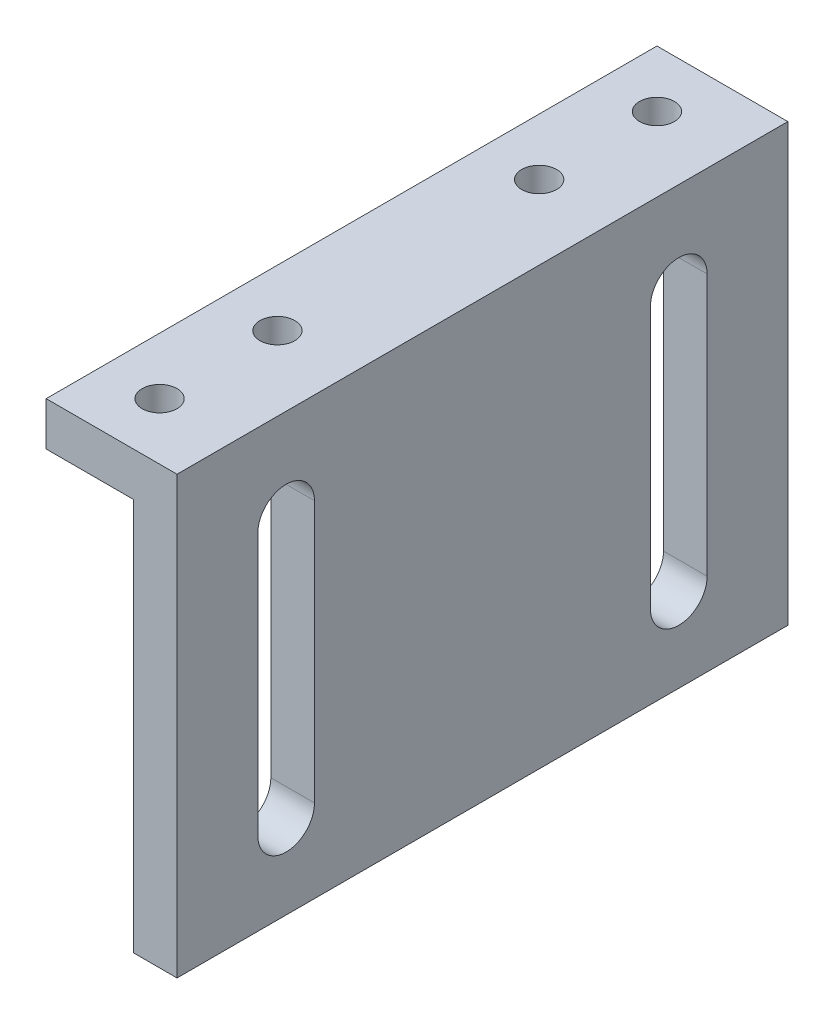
ISO-10303-21;
HEADER;
FILE_DESCRIPTION(('STEP AP214'),'2;1');
FILE_NAME('part.step','',(''),(''),'','','');
FILE_SCHEMA(('AUTOMOTIVE_DESIGN { 1 0 10303 214 1 1 1 1 }'));
ENDSEC;
DATA;
#1=APPLICATION_CONTEXT('core data for automotive mechanical design processes');
#2=APPLICATION_PROTOCOL_DEFINITION('international standard','automotive_design',2000,#1);
#3=PRODUCT_CONTEXT('',#1,'mechanical');
#4=PRODUCT('Part','Part','',(#3));
#5=PRODUCT_RELATED_PRODUCT_CATEGORY('part','',(#4));
#6=PRODUCT_DEFINITION_FORMATION('','',#4);
#7=PRODUCT_DEFINITION_CONTEXT('part definition',#1,'design');
#8=PRODUCT_DEFINITION('design','',#6,#7);
#9=PRODUCT_DEFINITION_SHAPE('','',#8);
#10=(LENGTH_UNIT() NAMED_UNIT(*) SI_UNIT(.MILLI.,.METRE.));
#11=(NAMED_UNIT(*) PLANE_ANGLE_UNIT() SI_UNIT($,.RADIAN.));
#12=(NAMED_UNIT(*) SI_UNIT($,.STERADIAN.) SOLID_ANGLE_UNIT());
#13=UNCERTAINTY_MEASURE_WITH_UNIT(LENGTH_MEASURE(1.E-05),#10,'distance_accuracy_value','');
#14=(GEOMETRIC_REPRESENTATION_CONTEXT(3) GLOBAL_UNCERTAINTY_ASSIGNED_CONTEXT((#13)) GLOBAL_UNIT_ASSIGNED_CONTEXT((#10,
#11,#12)) REPRESENTATION_CONTEXT('',''));
#15=CARTESIAN_POINT('',(0.,0.,0.));
#16=DIRECTION('',(0.,0.,1.));
#17=DIRECTION('',(1.,0.,0.));
#18=AXIS2_PLACEMENT_3D('',#15,#16,#17);
#19=CARTESIAN_POINT('',(3.5,-5.,0.));
#20=DIRECTION('',(0.,-1.,0.));
#21=DIRECTION('',(0.,0.,-1.));
#22=AXIS2_PLACEMENT_3D('',#19,#20,#21);
#23=PLANE('',#22);
#24=CARTESIAN_POINT('',(0.,-5.,28.5));
#25=DIRECTION('',(0.,1.,0.));
#26=DIRECTION('',(-1.,0.,0.));
#27=AXIS2_PLACEMENT_3D('',#24,#25,#26);
#28=CIRCLE('',#27,2.);
#29=CARTESIAN_POINT('',(-2.,-5.,28.5));
#30=VERTEX_POINT('',#29);
#31=EDGE_CURVE('E137',#30,#30,#28,.T.);
#32=ORIENTED_EDGE('',*,*,#31,.T.);
#33=EDGE_LOOP('',(#32));
#34=FACE_BOUND('',#33,.T.);
#35=CARTESIAN_POINT('',(0.,-5.,15.));
#36=DIRECTION('',(0.,1.,0.));
#37=DIRECTION('',(-1.,0.,0.));
#38=AXIS2_PLACEMENT_3D('',#35,#36,#37);
#39=CIRCLE('',#38,2.);
#40=CARTESIAN_POINT('',(-2.,-5.,15.));
#41=VERTEX_POINT('',#40);
#42=EDGE_CURVE('E197',#41,#41,#39,.T.);
#43=ORIENTED_EDGE('',*,*,#42,.T.);
#44=EDGE_LOOP('',(#43));
#45=FACE_BOUND('',#44,.T.);
#46=CARTESIAN_POINT('',(0.,-5.,-15.));
#47=DIRECTION('',(0.,1.,0.));
#48=DIRECTION('',(-1.,0.,0.));
#49=AXIS2_PLACEMENT_3D('',#46,#47,#48);
#50=CIRCLE('',#49,2.);
#51=CARTESIAN_POINT('',(-2.,-5.,-15.));
#52=VERTEX_POINT('',#51);
#53=EDGE_CURVE('E199',#52,#52,#50,.T.);
#54=ORIENTED_EDGE('',*,*,#53,.T.);
#55=EDGE_LOOP('',(#54));
#56=FACE_BOUND('',#55,.T.);
#57=CARTESIAN_POINT('',(0.,-5.,-28.5));
#58=DIRECTION('',(0.,1.,0.));
#59=DIRECTION('',(-1.,0.,0.));
#60=AXIS2_PLACEMENT_3D('',#57,#58,#59);
#61=CIRCLE('',#60,2.);
#62=CARTESIAN_POINT('',(-2.,-5.,-28.5));
#63=VERTEX_POINT('',#62);
#64=EDGE_CURVE('E18',#63,#63,#61,.T.);
#65=ORIENTED_EDGE('',*,*,#64,.T.);
#66=EDGE_LOOP('',(#65));
#67=FACE_BOUND('',#66,.T.);
#68=DIRECTION('',(1.,0.,0.));
#69=VECTOR('',#68,1.);
#70=CARTESIAN_POINT('',(4.46153846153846,-5.,-35.));
#71=LINE('',#70,#69);
#72=CARTESIAN_POINT('',(-6.5,-5.,-35.));
#73=VERTEX_POINT('',#72);
#74=CARTESIAN_POINT('',(3.5,-5.,-35.));
#75=VERTEX_POINT('',#74);
#76=EDGE_CURVE('E238',#73,#75,#71,.T.);
#77=ORIENTED_EDGE('',*,*,#76,.T.);
#78=DIRECTION('',(0.,0.,1.));
#79=VECTOR('',#78,1.);
#80=CARTESIAN_POINT('',(3.5,-5.,0.));
#81=LINE('',#80,#79);
#82=CARTESIAN_POINT('',(3.5,-5.,35.));
#83=VERTEX_POINT('',#82);
#84=EDGE_CURVE('E116',#83,#75,#81,.F.);
#85=ORIENTED_EDGE('',*,*,#84,.F.);
#86=DIRECTION('',(1.,0.,0.));
#87=VECTOR('',#86,1.);
#88=CARTESIAN_POINT('',(4.46153846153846,-5.,35.));
#89=LINE('',#88,#87);
#90=CARTESIAN_POINT('',(-6.5,-5.,35.));
#91=VERTEX_POINT('',#90);
#92=EDGE_CURVE('E127',#91,#83,#89,.T.);
#93=ORIENTED_EDGE('',*,*,#92,.F.);
#94=DIRECTION('',(0.,0.,1.));
#95=VECTOR('',#94,1.);
#96=CARTESIAN_POINT('',(-6.5,-5.,0.));
#97=LINE('',#96,#95);
#98=EDGE_CURVE('E120',#73,#91,#97,.T.);
#99=ORIENTED_EDGE('',*,*,#98,.F.);
#100=EDGE_LOOP('',(#77,#85,#93,#99));
#101=FACE_BOUND('',#100,.T.);
#102=ADVANCED_FACE('F15',(#34,#45,#56,#67,#101),#23,.T.);
#103=CARTESIAN_POINT('',(-6.5,-5.,0.));
#104=DIRECTION('',(-1.,0.,0.));
#105=DIRECTION('',(0.,0.,1.));
#106=AXIS2_PLACEMENT_3D('',#103,#104,#105);
#107=PLANE('',#106);
#108=DIRECTION('',(0.,1.,0.));
#109=VECTOR('',#108,1.);
#110=CARTESIAN_POINT('',(-6.5,-21.5384615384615,-35.));
#111=LINE('',#110,#109);
#112=CARTESIAN_POINT('',(-6.5,0.,-35.));
#113=VERTEX_POINT('',#112);
#114=EDGE_CURVE('E92',#113,#73,#111,.F.);
#115=ORIENTED_EDGE('',*,*,#114,.T.);
#116=ORIENTED_EDGE('',*,*,#98,.T.);
#117=DIRECTION('',(0.,1.,0.));
#118=VECTOR('',#117,1.);
#119=CARTESIAN_POINT('',(-6.5,-21.5384615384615,35.));
#120=LINE('',#119,#118);
#121=CARTESIAN_POINT('',(-6.5,0.,35.));
#122=VERTEX_POINT('',#121);
#123=EDGE_CURVE('E123',#122,#91,#120,.F.);
#124=ORIENTED_EDGE('',*,*,#123,.F.);
#125=DIRECTION('',(0.,0.,1.));
#126=VECTOR('',#125,1.);
#127=CARTESIAN_POINT('',(-6.5,0.,0.));
#128=LINE('',#127,#126);
#129=EDGE_CURVE('E194',#113,#122,#128,.T.);
#130=ORIENTED_EDGE('',*,*,#129,.F.);
#131=EDGE_LOOP('',(#115,#116,#124,#130));
#132=FACE_BOUND('',#131,.T.);
#133=ADVANCED_FACE('F121',(#132),#107,.T.);
#134=CARTESIAN_POINT('',(0.,-5.,-28.5));
#135=DIRECTION('',(0.,1.,0.));
#136=DIRECTION('',(-1.,0.,0.));
#137=AXIS2_PLACEMENT_3D('',#134,#135,#136);
#138=CYLINDRICAL_SURFACE('',#137,2.);
#139=ORIENTED_EDGE('',*,*,#64,.F.);
#140=EDGE_LOOP('',(#139));
#141=FACE_BOUND('',#140,.T.);
#142=CARTESIAN_POINT('',(0.,0.,-28.5));
#143=DIRECTION('',(0.,1.,0.));
#144=DIRECTION('',(-1.,0.,0.));
#145=AXIS2_PLACEMENT_3D('',#142,#143,#144);
#146=CIRCLE('',#145,2.);
#147=CARTESIAN_POINT('',(-2.,0.,-28.5));
#148=VERTEX_POINT('',#147);
#149=EDGE_CURVE('E191',#148,#148,#146,.F.);
#150=ORIENTED_EDGE('',*,*,#149,.F.);
#151=EDGE_LOOP('',(#150));
#152=FACE_BOUND('',#151,.T.);
#153=ADVANCED_FACE('F207',(#141,#152),#138,.F.);
#154=CARTESIAN_POINT('',(0.,-5.,-15.));
#155=DIRECTION('',(0.,1.,0.));
#156=DIRECTION('',(-1.,0.,0.));
#157=AXIS2_PLACEMENT_3D('',#154,#155,#156);
#158=CYLINDRICAL_SURFACE('',#157,2.);
#159=ORIENTED_EDGE('',*,*,#53,.F.);
#160=EDGE_LOOP('',(#159));
#161=FACE_BOUND('',#160,.T.);
#162=CARTESIAN_POINT('',(0.,0.,-15.));
#163=DIRECTION('',(0.,1.,0.));
#164=DIRECTION('',(-1.,0.,0.));
#165=AXIS2_PLACEMENT_3D('',#162,#163,#164);
#166=CIRCLE('',#165,2.);
#167=CARTESIAN_POINT('',(-2.,0.,-15.));
#168=VERTEX_POINT('',#167);
#169=EDGE_CURVE('E188',#168,#168,#166,.F.);
#170=ORIENTED_EDGE('',*,*,#169,.F.);
#171=EDGE_LOOP('',(#170));
#172=FACE_BOUND('',#171,.T.);
#173=ADVANCED_FACE('F210',(#161,#172),#158,.F.);
#174=CARTESIAN_POINT('',(0.,-5.,15.));
#175=DIRECTION('',(0.,1.,0.));
#176=DIRECTION('',(-1.,0.,0.));
#177=AXIS2_PLACEMENT_3D('',#174,#175,#176);
#178=CYLINDRICAL_SURFACE('',#177,2.);
#179=ORIENTED_EDGE('',*,*,#42,.F.);
#180=EDGE_LOOP('',(#179));
#181=FACE_BOUND('',#180,.T.);
#182=CARTESIAN_POINT('',(0.,0.,15.));
#183=DIRECTION('',(0.,1.,0.));
#184=DIRECTION('',(-1.,0.,0.));
#185=AXIS2_PLACEMENT_3D('',#182,#183,#184);
#186=CIRCLE('',#185,2.);
#187=CARTESIAN_POINT('',(-2.,0.,15.));
#188=VERTEX_POINT('',#187);
#189=EDGE_CURVE('E185',#188,#188,#186,.F.);
#190=ORIENTED_EDGE('',*,*,#189,.F.);
#191=EDGE_LOOP('',(#190));
#192=FACE_BOUND('',#191,.T.);
#193=ADVANCED_FACE('F414',(#181,#192),#178,.F.);
#194=CARTESIAN_POINT('',(0.,-5.,28.5));
#195=DIRECTION('',(0.,1.,0.));
#196=DIRECTION('',(-1.,0.,0.));
#197=AXIS2_PLACEMENT_3D('',#194,#195,#196);
#198=CYLINDRICAL_SURFACE('',#197,2.);
#199=ORIENTED_EDGE('',*,*,#31,.F.);
#200=EDGE_LOOP('',(#199));
#201=FACE_BOUND('',#200,.T.);
#202=CARTESIAN_POINT('',(0.,0.,28.5));
#203=DIRECTION('',(0.,1.,0.));
#204=DIRECTION('',(-1.,0.,0.));
#205=AXIS2_PLACEMENT_3D('',#202,#203,#204);
#206=CIRCLE('',#205,2.);
#207=CARTESIAN_POINT('',(-2.,0.,28.5));
#208=VERTEX_POINT('',#207);
#209=EDGE_CURVE('E182',#208,#208,#206,.F.);
#210=ORIENTED_EDGE('',*,*,#209,.F.);
#211=EDGE_LOOP('',(#210));
#212=FACE_BOUND('',#211,.T.);
#213=ADVANCED_FACE('F422',(#201,#212),#198,.F.);
#214=CARTESIAN_POINT('',(3.5,-50.,0.));
#215=DIRECTION('',(-1.,0.,0.));
#216=DIRECTION('',(0.,0.,1.));
#217=AXIS2_PLACEMENT_3D('',#214,#215,#216);
#218=PLANE('',#217);
#219=DIRECTION('',(0.,1.,0.));
#220=VECTOR('',#219,1.);
#221=CARTESIAN_POINT('',(3.5,-10.5,25.75));
#222=LINE('',#221,#220);
#223=CARTESIAN_POINT('',(3.5,-10.5,25.75));
#224=VERTEX_POINT('',#223);
#225=CARTESIAN_POINT('',(3.5,-40.5,25.75));
#226=VERTEX_POINT('',#225);
#227=EDGE_CURVE('E145',#224,#226,#222,.F.);
#228=ORIENTED_EDGE('',*,*,#227,.T.);
#229=CARTESIAN_POINT('',(3.5,-40.5,22.5));
#230=DIRECTION('',(-1.,0.,0.));
#231=DIRECTION('',(0.,0.,1.));
#232=AXIS2_PLACEMENT_3D('',#229,#230,#231);
#233=CIRCLE('',#232,3.25);
#234=CARTESIAN_POINT('',(3.5,-40.5,19.25));
#235=VERTEX_POINT('',#234);
#236=EDGE_CURVE('E174',#226,#235,#233,.F.);
#237=ORIENTED_EDGE('',*,*,#236,.T.);
#238=DIRECTION('',(0.,1.,0.));
#239=VECTOR('',#238,1.);
#240=CARTESIAN_POINT('',(3.5,-40.5,19.25));
#241=LINE('',#240,#239);
#242=CARTESIAN_POINT('',(3.5,-10.5,19.25));
#243=VERTEX_POINT('',#242);
#244=EDGE_CURVE('E141',#235,#243,#241,.T.);
#245=ORIENTED_EDGE('',*,*,#244,.T.);
#246=CARTESIAN_POINT('',(3.5,-10.5,22.5));
#247=DIRECTION('',(-1.,0.,0.));
#248=DIRECTION('',(0.,0.,1.));
#249=AXIS2_PLACEMENT_3D('',#246,#247,#248);
#250=CIRCLE('',#249,3.25);
#251=EDGE_CURVE('E169',#243,#224,#250,.F.);
#252=ORIENTED_EDGE('',*,*,#251,.T.);
#253=EDGE_LOOP('',(#228,#237,#245,#252));
#254=FACE_BOUND('',#253,.T.);
#255=CARTESIAN_POINT('',(3.5,-40.5,-22.5));
#256=DIRECTION('',(-1.,0.,0.));
#257=DIRECTION('',(0.,0.,1.));
#258=AXIS2_PLACEMENT_3D('',#255,#256,#257);
#259=CIRCLE('',#258,3.25);
#260=CARTESIAN_POINT('',(3.5,-40.5,-19.25));
#261=VERTEX_POINT('',#260);
#262=CARTESIAN_POINT('',(3.5,-40.5,-25.75));
#263=VERTEX_POINT('',#262);
#264=EDGE_CURVE('E177',#261,#263,#259,.F.);
#265=ORIENTED_EDGE('',*,*,#264,.T.);
#266=DIRECTION('',(0.,1.,0.));
#267=VECTOR('',#266,1.);
#268=CARTESIAN_POINT('',(3.5,-40.5,-25.75));
#269=LINE('',#268,#267);
#270=CARTESIAN_POINT('',(3.5,-10.5,-25.75));
#271=VERTEX_POINT('',#270);
#272=EDGE_CURVE('E152',#263,#271,#269,.T.);
#273=ORIENTED_EDGE('',*,*,#272,.T.);
#274=CARTESIAN_POINT('',(3.5,-10.5,-22.5));
#275=DIRECTION('',(-1.,0.,0.));
#276=DIRECTION('',(0.,0.,1.));
#277=AXIS2_PLACEMENT_3D('',#274,#275,#276);
#278=CIRCLE('',#277,3.25);
#279=CARTESIAN_POINT('',(3.5,-10.5,-19.25));
#280=VERTEX_POINT('',#279);
#281=EDGE_CURVE('E83',#271,#280,#278,.F.);
#282=ORIENTED_EDGE('',*,*,#281,.T.);
#283=DIRECTION('',(0.,1.,0.));
#284=VECTOR('',#283,1.);
#285=CARTESIAN_POINT('',(3.5,-10.5,-19.25));
#286=LINE('',#285,#284);
#287=EDGE_CURVE('E144',#280,#261,#286,.F.);
#288=ORIENTED_EDGE('',*,*,#287,.T.);
#289=EDGE_LOOP('',(#265,#273,#282,#288));
#290=FACE_BOUND('',#289,.T.);
#291=DIRECTION('',(0.,1.,0.));
#292=VECTOR('',#291,1.);
#293=CARTESIAN_POINT('',(3.5,-21.5384615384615,-35.));
#294=LINE('',#293,#292);
#295=CARTESIAN_POINT('',(3.5,-50.,-35.));
#296=VERTEX_POINT('',#295);
#297=EDGE_CURVE('E236',#75,#296,#294,.F.);
#298=ORIENTED_EDGE('',*,*,#297,.T.);
#299=DIRECTION('',(0.,0.,-1.));
#300=VECTOR('',#299,1.);
#301=CARTESIAN_POINT('',(3.5,-50.,0.));
#302=LINE('',#301,#300);
#303=CARTESIAN_POINT('',(3.5,-50.,35.));
#304=VERTEX_POINT('',#303);
#305=EDGE_CURVE('E240',#304,#296,#302,.T.);
#306=ORIENTED_EDGE('',*,*,#305,.F.);
#307=DIRECTION('',(0.,1.,0.));
#308=VECTOR('',#307,1.);
#309=CARTESIAN_POINT('',(3.5,-21.5384615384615,35.));
#310=LINE('',#309,#308);
#311=EDGE_CURVE('E129',#83,#304,#310,.F.);
#312=ORIENTED_EDGE('',*,*,#311,.F.);
#313=ORIENTED_EDGE('',*,*,#84,.T.);
#314=EDGE_LOOP('',(#298,#306,#312,#313));
#315=FACE_BOUND('',#314,.T.);
#316=ADVANCED_FACE('F249',(#254,#290,#315),#218,.T.);
#317=CARTESIAN_POINT('',(4.46153846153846,-21.5384615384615,35.));
#318=DIRECTION('',(0.,0.,1.));
#319=DIRECTION('',(1.,0.,0.));
#320=AXIS2_PLACEMENT_3D('',#317,#318,#319);
#321=PLANE('',#320);
#322=ORIENTED_EDGE('',*,*,#311,.T.);
#323=DIRECTION('',(1.,0.,0.));
#324=VECTOR('',#323,1.);
#325=CARTESIAN_POINT('',(8.5,-50.,35.));
#326=LINE('',#325,#324);
#327=CARTESIAN_POINT('',(8.5,-50.,35.));
#328=VERTEX_POINT('',#327);
#329=EDGE_CURVE('E243',#328,#304,#326,.F.);
#330=ORIENTED_EDGE('',*,*,#329,.F.);
#331=DIRECTION('',(0.,1.,0.));
#332=VECTOR('',#331,1.);
#333=CARTESIAN_POINT('',(8.5,0.,35.));
#334=LINE('',#333,#332);
#335=CARTESIAN_POINT('',(8.5,0.,35.));
#336=VERTEX_POINT('',#335);
#337=EDGE_CURVE('E172',#336,#328,#334,.F.);
#338=ORIENTED_EDGE('',*,*,#337,.F.);
#339=DIRECTION('',(1.,0.,0.));
#340=VECTOR('',#339,1.);
#341=CARTESIAN_POINT('',(-6.5,0.,35.));
#342=LINE('',#341,#340);
#343=EDGE_CURVE('E134',#122,#336,#342,.T.);
#344=ORIENTED_EDGE('',*,*,#343,.F.);
#345=ORIENTED_EDGE('',*,*,#123,.T.);
#346=ORIENTED_EDGE('',*,*,#92,.T.);
#347=EDGE_LOOP('',(#322,#330,#338,#344,#345,#346));
#348=FACE_BOUND('',#347,.T.);
#349=ADVANCED_FACE('F131',(#348),#321,.T.);
#350=CARTESIAN_POINT('',(8.5,-50.,0.));
#351=DIRECTION('',(0.,-1.,0.));
#352=DIRECTION('',(0.,0.,-1.));
#353=AXIS2_PLACEMENT_3D('',#350,#351,#352);
#354=PLANE('',#353);
#355=DIRECTION('',(1.,0.,0.));
#356=VECTOR('',#355,1.);
#357=CARTESIAN_POINT('',(4.46153846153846,-50.,-35.));
#358=LINE('',#357,#356);
#359=CARTESIAN_POINT('',(8.5,-50.,-35.));
#360=VERTEX_POINT('',#359);
#361=EDGE_CURVE('E233',#296,#360,#358,.T.);
#362=ORIENTED_EDGE('',*,*,#361,.T.);
#363=DIRECTION('',(0.,0.,-1.));
#364=VECTOR('',#363,1.);
#365=CARTESIAN_POINT('',(8.5,-50.,0.));
#366=LINE('',#365,#364);
#367=EDGE_CURVE('E255',#328,#360,#366,.T.);
#368=ORIENTED_EDGE('',*,*,#367,.F.);
#369=ORIENTED_EDGE('',*,*,#329,.T.);
#370=ORIENTED_EDGE('',*,*,#305,.T.);
#371=EDGE_LOOP('',(#362,#368,#369,#370));
#372=FACE_BOUND('',#371,.T.);
#373=ADVANCED_FACE('F253',(#372),#354,.T.);
#374=CARTESIAN_POINT('',(4.46153846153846,-21.5384615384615,-35.));
#375=DIRECTION('',(0.,0.,1.));
#376=DIRECTION('',(1.,0.,0.));
#377=AXIS2_PLACEMENT_3D('',#374,#375,#376);
#378=PLANE('',#377);
#379=DIRECTION('',(1.,0.,0.));
#380=VECTOR('',#379,1.);
#381=CARTESIAN_POINT('',(-6.5,0.,-35.));
#382=LINE('',#381,#380);
#383=CARTESIAN_POINT('',(8.5,0.,-35.));
#384=VERTEX_POINT('',#383);
#385=EDGE_CURVE('E223',#384,#113,#382,.F.);
#386=ORIENTED_EDGE('',*,*,#385,.F.);
#387=DIRECTION('',(0.,1.,0.));
#388=VECTOR('',#387,1.);
#389=CARTESIAN_POINT('',(8.5,0.,-35.));
#390=LINE('',#389,#388);
#391=EDGE_CURVE('E259',#360,#384,#390,.T.);
#392=ORIENTED_EDGE('',*,*,#391,.F.);
#393=ORIENTED_EDGE('',*,*,#361,.F.);
#394=ORIENTED_EDGE('',*,*,#297,.F.);
#395=ORIENTED_EDGE('',*,*,#76,.F.);
#396=ORIENTED_EDGE('',*,*,#114,.F.);
#397=EDGE_LOOP('',(#386,#392,#393,#394,#395,#396));
#398=FACE_BOUND('',#397,.T.);
#399=ADVANCED_FACE('F218',(#398),#378,.F.);
#400=CARTESIAN_POINT('',(-6.5,0.,0.));
#401=DIRECTION('',(0.,1.,0.));
#402=DIRECTION('',(0.,0.,1.));
#403=AXIS2_PLACEMENT_3D('',#400,#401,#402);
#404=PLANE('',#403);
#405=ORIENTED_EDGE('',*,*,#209,.T.);
#406=EDGE_LOOP('',(#405));
#407=FACE_BOUND('',#406,.T.);
#408=ORIENTED_EDGE('',*,*,#189,.T.);
#409=EDGE_LOOP('',(#408));
#410=FACE_BOUND('',#409,.T.);
#411=ORIENTED_EDGE('',*,*,#169,.T.);
#412=EDGE_LOOP('',(#411));
#413=FACE_BOUND('',#412,.T.);
#414=ORIENTED_EDGE('',*,*,#149,.T.);
#415=EDGE_LOOP('',(#414));
#416=FACE_BOUND('',#415,.T.);
#417=ORIENTED_EDGE('',*,*,#385,.T.);
#418=ORIENTED_EDGE('',*,*,#129,.T.);
#419=ORIENTED_EDGE('',*,*,#343,.T.);
#420=DIRECTION('',(0.,0.,-1.));
#421=VECTOR('',#420,1.);
#422=CARTESIAN_POINT('',(8.5,0.,0.));
#423=LINE('',#422,#421);
#424=EDGE_CURVE('E168',#384,#336,#423,.F.);
#425=ORIENTED_EDGE('',*,*,#424,.F.);
#426=EDGE_LOOP('',(#417,#418,#419,#425));
#427=FACE_BOUND('',#426,.T.);
#428=ADVANCED_FACE('F214',(#407,#410,#413,#416,#427),#404,.T.);
#429=CARTESIAN_POINT('',(8.5,-10.5,-22.5));
#430=DIRECTION('',(-1.,0.,0.));
#431=DIRECTION('',(0.,0.,1.));
#432=AXIS2_PLACEMENT_3D('',#429,#430,#431);
#433=CYLINDRICAL_SURFACE('',#432,3.25);
#434=DIRECTION('',(-1.,0.,0.));
#435=VECTOR('',#434,1.);
#436=CARTESIAN_POINT('',(8.5,-10.5,-25.75));
#437=LINE('',#436,#435);
#438=CARTESIAN_POINT('',(8.5,-10.5,-25.75));
#439=VERTEX_POINT('',#438);
#440=EDGE_CURVE('E154',#271,#439,#437,.F.);
#441=ORIENTED_EDGE('',*,*,#440,.T.);
#442=CARTESIAN_POINT('',(8.5,-10.5,-22.5));
#443=DIRECTION('',(-1.,0.,0.));
#444=DIRECTION('',(0.,0.,1.));
#445=AXIS2_PLACEMENT_3D('',#442,#443,#444);
#446=CIRCLE('',#445,3.25);
#447=CARTESIAN_POINT('',(8.5,-10.5,-19.25));
#448=VERTEX_POINT('',#447);
#449=EDGE_CURVE('E165',#448,#439,#446,.T.);
#450=ORIENTED_EDGE('',*,*,#449,.F.);
#451=DIRECTION('',(1.,0.,0.));
#452=VECTOR('',#451,1.);
#453=CARTESIAN_POINT('',(8.5,-10.5,-19.25));
#454=LINE('',#453,#452);
#455=EDGE_CURVE('E151',#448,#280,#454,.F.);
#456=ORIENTED_EDGE('',*,*,#455,.T.);
#457=ORIENTED_EDGE('',*,*,#281,.F.);
#458=EDGE_LOOP('',(#441,#450,#456,#457));
#459=FACE_BOUND('',#458,.T.);
#460=ADVANCED_FACE('F217',(#459),#433,.F.);
#461=CARTESIAN_POINT('',(8.5,-40.5,-25.75));
#462=DIRECTION('',(0.,0.,-1.));
#463=DIRECTION('',(-1.,0.,0.));
#464=AXIS2_PLACEMENT_3D('',#461,#462,#463);
#465=PLANE('',#464);
#466=DIRECTION('',(-1.,0.,0.));
#467=VECTOR('',#466,1.);
#468=CARTESIAN_POINT('',(8.5,-40.5,-25.75));
#469=LINE('',#468,#467);
#470=CARTESIAN_POINT('',(8.5,-40.5,-25.75));
#471=VERTEX_POINT('',#470);
#472=EDGE_CURVE('E153',#263,#471,#469,.F.);
#473=ORIENTED_EDGE('',*,*,#472,.T.);
#474=DIRECTION('',(0.,1.,0.));
#475=VECTOR('',#474,1.);
#476=CARTESIAN_POINT('',(8.5,0.,-25.75));
#477=LINE('',#476,#475);
#478=EDGE_CURVE('E164',#439,#471,#477,.F.);
#479=ORIENTED_EDGE('',*,*,#478,.F.);
#480=ORIENTED_EDGE('',*,*,#440,.F.);
#481=ORIENTED_EDGE('',*,*,#272,.F.);
#482=EDGE_LOOP('',(#473,#479,#480,#481));
#483=FACE_BOUND('',#482,.T.);
#484=ADVANCED_FACE('F277',(#483),#465,.F.);
#485=CARTESIAN_POINT('',(8.5,-40.5,-22.5));
#486=DIRECTION('',(-1.,0.,0.));
#487=DIRECTION('',(0.,0.,1.));
#488=AXIS2_PLACEMENT_3D('',#485,#486,#487);
#489=CYLINDRICAL_SURFACE('',#488,3.25);
#490=DIRECTION('',(1.,0.,0.));
#491=VECTOR('',#490,1.);
#492=CARTESIAN_POINT('',(8.5,-40.5,-19.25));
#493=LINE('',#492,#491);
#494=CARTESIAN_POINT('',(8.5,-40.5,-19.25));
#495=VERTEX_POINT('',#494);
#496=EDGE_CURVE('E180',#261,#495,#493,.T.);
#497=ORIENTED_EDGE('',*,*,#496,.T.);
#498=CARTESIAN_POINT('',(8.5,-40.5,-22.5));
#499=DIRECTION('',(-1.,0.,0.));
#500=DIRECTION('',(0.,0.,1.));
#501=AXIS2_PLACEMENT_3D('',#498,#499,#500);
#502=CIRCLE('',#501,3.25);
#503=EDGE_CURVE('E160',#471,#495,#502,.T.);
#504=ORIENTED_EDGE('',*,*,#503,.F.);
#505=ORIENTED_EDGE('',*,*,#472,.F.);
#506=ORIENTED_EDGE('',*,*,#264,.F.);
#507=EDGE_LOOP('',(#497,#504,#505,#506));
#508=FACE_BOUND('',#507,.T.);
#509=ADVANCED_FACE('F327',(#508),#489,.F.);
#510=CARTESIAN_POINT('',(8.5,-10.5,-19.25));
#511=DIRECTION('',(0.,0.,1.));
#512=DIRECTION('',(1.,0.,0.));
#513=AXIS2_PLACEMENT_3D('',#510,#511,#512);
#514=PLANE('',#513);
#515=ORIENTED_EDGE('',*,*,#455,.F.);
#516=DIRECTION('',(0.,1.,0.));
#517=VECTOR('',#516,1.);
#518=CARTESIAN_POINT('',(8.5,0.,-19.25));
#519=LINE('',#518,#517);
#520=EDGE_CURVE('E163',#495,#448,#519,.T.);
#521=ORIENTED_EDGE('',*,*,#520,.F.);
#522=ORIENTED_EDGE('',*,*,#496,.F.);
#523=ORIENTED_EDGE('',*,*,#287,.F.);
#524=EDGE_LOOP('',(#515,#521,#522,#523));
#525=FACE_BOUND('',#524,.T.);
#526=ADVANCED_FACE('F323',(#525),#514,.F.);
#527=CARTESIAN_POINT('',(8.5,-40.5,19.25));
#528=DIRECTION('',(0.,0.,-1.));
#529=DIRECTION('',(-1.,0.,0.));
#530=AXIS2_PLACEMENT_3D('',#527,#528,#529);
#531=PLANE('',#530);
#532=DIRECTION('',(-1.,0.,0.));
#533=VECTOR('',#532,1.);
#534=CARTESIAN_POINT('',(8.5,-40.5,19.25));
#535=LINE('',#534,#533);
#536=CARTESIAN_POINT('',(8.5,-40.5,19.25));
#537=VERTEX_POINT('',#536);
#538=EDGE_CURVE('E143',#235,#537,#535,.F.);
#539=ORIENTED_EDGE('',*,*,#538,.T.);
#540=DIRECTION('',(0.,1.,0.));
#541=VECTOR('',#540,1.);
#542=CARTESIAN_POINT('',(8.5,0.,19.25));
#543=LINE('',#542,#541);
#544=CARTESIAN_POINT('',(8.5,-10.5,19.25));
#545=VERTEX_POINT('',#544);
#546=EDGE_CURVE('E159',#545,#537,#543,.F.);
#547=ORIENTED_EDGE('',*,*,#546,.F.);
#548=DIRECTION('',(-1.,0.,0.));
#549=VECTOR('',#548,1.);
#550=CARTESIAN_POINT('',(8.5,-10.5,19.25));
#551=LINE('',#550,#549);
#552=EDGE_CURVE('E173',#545,#243,#551,.T.);
#553=ORIENTED_EDGE('',*,*,#552,.T.);
#554=ORIENTED_EDGE('',*,*,#244,.F.);
#555=EDGE_LOOP('',(#539,#547,#553,#554));
#556=FACE_BOUND('',#555,.T.);
#557=ADVANCED_FACE('F319',(#556),#531,.F.);
#558=CARTESIAN_POINT('',(8.5,-40.5,22.5));
#559=DIRECTION('',(-1.,0.,0.));
#560=DIRECTION('',(0.,0.,1.));
#561=AXIS2_PLACEMENT_3D('',#558,#559,#560);
#562=CYLINDRICAL_SURFACE('',#561,3.25);
#563=DIRECTION('',(1.,0.,0.));
#564=VECTOR('',#563,1.);
#565=CARTESIAN_POINT('',(8.5,-40.5,25.75));
#566=LINE('',#565,#564);
#567=CARTESIAN_POINT('',(8.5,-40.5,25.75));
#568=VERTEX_POINT('',#567);
#569=EDGE_CURVE('E148',#226,#568,#566,.T.);
#570=ORIENTED_EDGE('',*,*,#569,.T.);
#571=CARTESIAN_POINT('',(8.5,-40.5,22.5));
#572=DIRECTION('',(-1.,0.,0.));
#573=DIRECTION('',(0.,0.,1.));
#574=AXIS2_PLACEMENT_3D('',#571,#572,#573);
#575=CIRCLE('',#574,3.25);
#576=EDGE_CURVE('E156',#537,#568,#575,.T.);
#577=ORIENTED_EDGE('',*,*,#576,.F.);
#578=ORIENTED_EDGE('',*,*,#538,.F.);
#579=ORIENTED_EDGE('',*,*,#236,.F.);
#580=EDGE_LOOP('',(#570,#577,#578,#579));
#581=FACE_BOUND('',#580,.T.);
#582=ADVANCED_FACE('F316',(#581),#562,.F.);
#583=CARTESIAN_POINT('',(8.5,-10.5,25.75));
#584=DIRECTION('',(0.,0.,1.));
#585=DIRECTION('',(1.,0.,0.));
#586=AXIS2_PLACEMENT_3D('',#583,#584,#585);
#587=PLANE('',#586);
#588=DIRECTION('',(-1.,0.,0.));
#589=VECTOR('',#588,1.);
#590=CARTESIAN_POINT('',(8.5,-10.5,25.75));
#591=LINE('',#590,#589);
#592=CARTESIAN_POINT('',(8.5,-10.5,25.75));
#593=VERTEX_POINT('',#592);
#594=EDGE_CURVE('E33',#224,#593,#591,.F.);
#595=ORIENTED_EDGE('',*,*,#594,.T.);
#596=DIRECTION('',(0.,1.,0.));
#597=VECTOR('',#596,1.);
#598=CARTESIAN_POINT('',(8.5,0.,25.75));
#599=LINE('',#598,#597);
#600=EDGE_CURVE('E24',#568,#593,#599,.T.);
#601=ORIENTED_EDGE('',*,*,#600,.F.);
#602=ORIENTED_EDGE('',*,*,#569,.F.);
#603=ORIENTED_EDGE('',*,*,#227,.F.);
#604=EDGE_LOOP('',(#595,#601,#602,#603));
#605=FACE_BOUND('',#604,.T.);
#606=ADVANCED_FACE('F309',(#605),#587,.F.);
#607=CARTESIAN_POINT('',(8.5,-10.5,22.5));
#608=DIRECTION('',(-1.,0.,0.));
#609=DIRECTION('',(0.,0.,1.));
#610=AXIS2_PLACEMENT_3D('',#607,#608,#609);
#611=CYLINDRICAL_SURFACE('',#610,3.25);
#612=ORIENTED_EDGE('',*,*,#552,.F.);
#613=CARTESIAN_POINT('',(8.5,-10.5,22.5));
#614=DIRECTION('',(-1.,0.,0.));
#615=DIRECTION('',(0.,0.,1.));
#616=AXIS2_PLACEMENT_3D('',#613,#614,#615);
#617=CIRCLE('',#616,3.25);
#618=EDGE_CURVE('E10',#593,#545,#617,.T.);
#619=ORIENTED_EDGE('',*,*,#618,.F.);
#620=ORIENTED_EDGE('',*,*,#594,.F.);
#621=ORIENTED_EDGE('',*,*,#251,.F.);
#622=EDGE_LOOP('',(#612,#619,#620,#621));
#623=FACE_BOUND('',#622,.T.);
#624=ADVANCED_FACE('F302',(#623),#611,.F.);
#625=CARTESIAN_POINT('',(8.5,0.,0.));
#626=DIRECTION('',(1.,0.,0.));
#627=DIRECTION('',(0.,0.,-1.));
#628=AXIS2_PLACEMENT_3D('',#625,#626,#627);
#629=PLANE('',#628);
#630=ORIENTED_EDGE('',*,*,#600,.T.);
#631=ORIENTED_EDGE('',*,*,#618,.T.);
#632=ORIENTED_EDGE('',*,*,#546,.T.);
#633=ORIENTED_EDGE('',*,*,#576,.T.);
#634=EDGE_LOOP('',(#630,#631,#632,#633));
#635=FACE_BOUND('',#634,.T.);
#636=ORIENTED_EDGE('',*,*,#503,.T.);
#637=ORIENTED_EDGE('',*,*,#520,.T.);
#638=ORIENTED_EDGE('',*,*,#449,.T.);
#639=ORIENTED_EDGE('',*,*,#478,.T.);
#640=EDGE_LOOP('',(#636,#637,#638,#639));
#641=FACE_BOUND('',#640,.T.);
#642=ORIENTED_EDGE('',*,*,#391,.T.);
#643=ORIENTED_EDGE('',*,*,#424,.T.);
#644=ORIENTED_EDGE('',*,*,#337,.T.);
#645=ORIENTED_EDGE('',*,*,#367,.T.);
#646=EDGE_LOOP('',(#642,#643,#644,#645));
#647=FACE_BOUND('',#646,.T.);
#648=ADVANCED_FACE('F261',(#635,#641,#647),#629,.T.);
#649=CLOSED_SHELL('',(#102,#133,#153,#173,#193,#213,#316,#349,#373,#399,#428,#460,#484,#509,
#526,#557,#582,#606,#624,#648));
#650=MANIFOLD_SOLID_BREP('B1',#649);
#651=ADVANCED_BREP_SHAPE_REPRESENTATION('',(#18,#650),#14);
#652=SHAPE_DEFINITION_REPRESENTATION(#9,#651);
ENDSEC;
END-ISO-10303-21;
